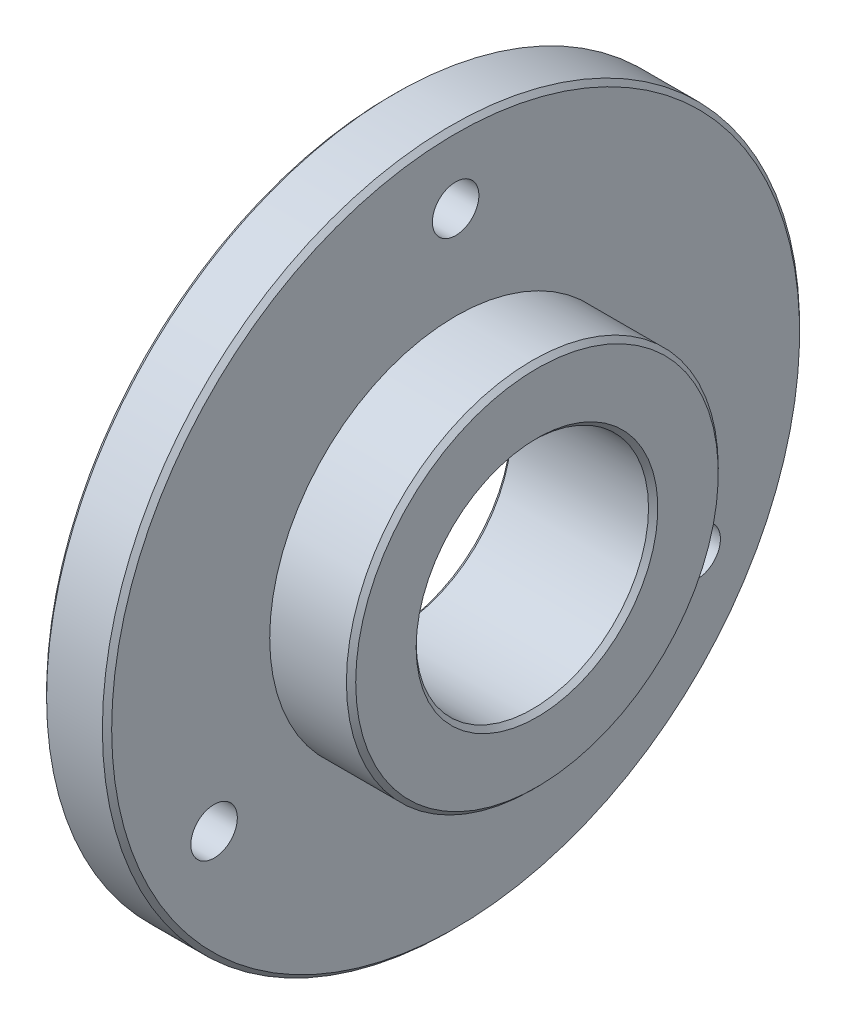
from build123d import *

# Parameters (mm, degrees)
ESQUISSE2_R                  = 1
ENL_V_MAT_EXTRU_1_DEPTH      = 2.8
R_P_TITION_CIRCULAIRE1_COUNT = 6
CHANFREIN1_SIZE              = 0.2


with BuildPart() as part:
    # Esquisse1 → R_volution1 (revolve)
    with BuildSketch(Plane.XY, mode=Mode.PRIVATE) as r_volution1_sk:
        Polygon((0, 5), (0, 15), (2.8, 15), (2.8, 8), (6.3, 8), (6.3, 5), align=None)
    revolve(r_volution1_sk.sketch.rotate(Axis((-51.259431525, 0, 0), (1, 0, 0)), 90), axis=Axis((-51.259431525, 0, 0), (1, 0, 0)))

    # Esquisse2 → Enl_v. mat.-Extru.1 (cut)
    with BuildSketch(Plane(origin=(2.8, 0, 0), x_dir=(0, 0, -1), z_dir=(1, 0, 0))):
        with Locations((0, 12)):
            Circle(ESQUISSE2_R)
    enl_v_mat_extru_1 = extrude(amount=-ENL_V_MAT_EXTRU_1_DEPTH, mode=Mode.SUBTRACT)

    # R_p_tition circulaire1: Enl_v. mat.-Extru.1 ×6 about axis, 3 skipped
    r_p_tition_circulaire1_axis = Axis((0, 0, 0), (1, 0, 0))
    add([enl_v_mat_extru_1.rotate(r_p_tition_circulaire1_axis, i * 360 / R_P_TITION_CIRCULAIRE1_COUNT) for i in range(1, R_P_TITION_CIRCULAIRE1_COUNT) if i not in (1, 3, 5)], mode=Mode.SUBTRACT)

    # Chanfrein1
    chanfrein1_edges = [part.edges().sort_by_distance(p)[0] for p in [
        (0, 0, -15),
        (0, 0, -5),
        (6.3, 0, -5),
        (6.3, 0, -8),
        (2.8, 0, -15),
    ]]
    chamfer(chanfrein1_edges, length=CHANFREIN1_SIZE)


solid = part.part
